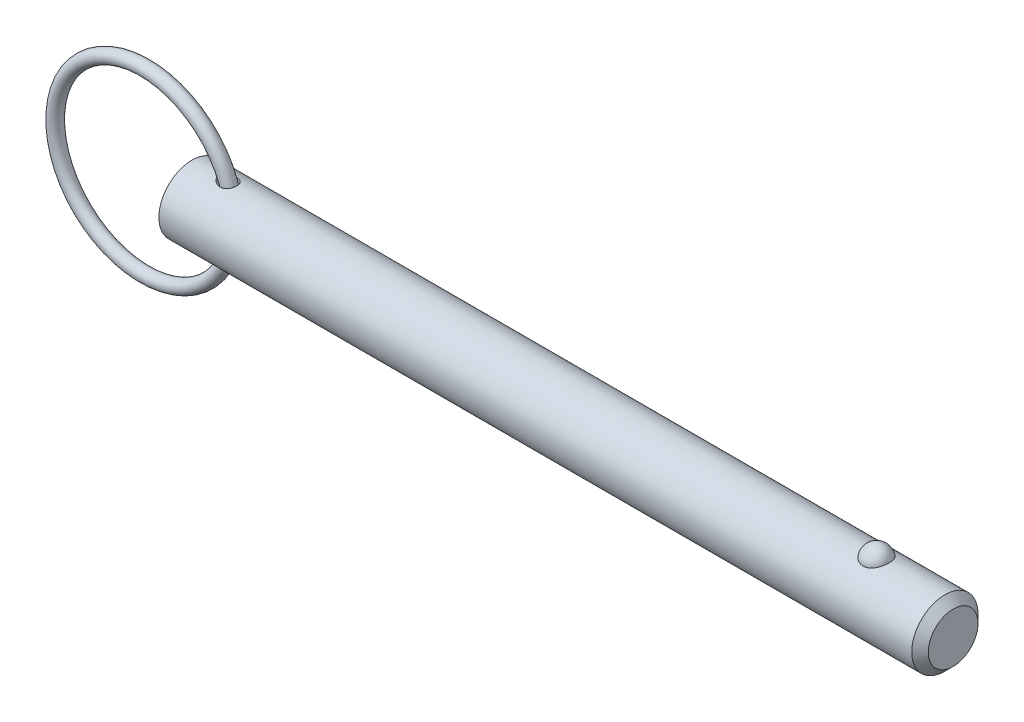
ISO-10303-21;
HEADER;
FILE_DESCRIPTION(('STEP AP214'),'2;1');
FILE_NAME('part.step','',(''),(''),'','','');
FILE_SCHEMA(('AUTOMOTIVE_DESIGN { 1 0 10303 214 1 1 1 1 }'));
ENDSEC;
DATA;
#1=APPLICATION_CONTEXT('core data for automotive mechanical design processes');
#2=APPLICATION_PROTOCOL_DEFINITION('international standard','automotive_design',2000,#1);
#3=PRODUCT_CONTEXT('',#1,'mechanical');
#4=PRODUCT('Part','Part','',(#3));
#5=PRODUCT_RELATED_PRODUCT_CATEGORY('part','',(#4));
#6=PRODUCT_DEFINITION_FORMATION('','',#4);
#7=PRODUCT_DEFINITION_CONTEXT('part definition',#1,'design');
#8=PRODUCT_DEFINITION('design','',#6,#7);
#9=PRODUCT_DEFINITION_SHAPE('','',#8);
#10=(LENGTH_UNIT() NAMED_UNIT(*) SI_UNIT(.MILLI.,.METRE.));
#11=(NAMED_UNIT(*) PLANE_ANGLE_UNIT() SI_UNIT($,.RADIAN.));
#12=(NAMED_UNIT(*) SI_UNIT($,.STERADIAN.) SOLID_ANGLE_UNIT());
#13=UNCERTAINTY_MEASURE_WITH_UNIT(LENGTH_MEASURE(1.E-05),#10,'distance_accuracy_value','');
#14=(GEOMETRIC_REPRESENTATION_CONTEXT(3) GLOBAL_UNCERTAINTY_ASSIGNED_CONTEXT((#13)) GLOBAL_UNIT_ASSIGNED_CONTEXT((#10,
#11,#12)) REPRESENTATION_CONTEXT('',''));
#15=CARTESIAN_POINT('',(0.,0.,0.));
#16=DIRECTION('',(0.,0.,1.));
#17=DIRECTION('',(1.,0.,0.));
#18=AXIS2_PLACEMENT_3D('',#15,#16,#17);
#19=CARTESIAN_POINT('',(-6.70471658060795,0.,0.));
#20=DIRECTION('',(0.,0.,1.));
#21=DIRECTION('',(1.,0.,0.));
#22=AXIS2_PLACEMENT_3D('',#19,#20,#21);
#23=TOROIDAL_SURFACE('',#22,12.7,0.940000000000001);
#24=CARTESIAN_POINT('',(6.93528341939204,0.,0.));
#25=VERTEX_POINT('',#24);
#26=VERTEX_LOOP('',#25);
#27=FACE_BOUND('',#26,.T.);
#28=ADVANCED_FACE('P0_F12',(#27),#23,.T.);
#29=CLOSED_SHELL('',(#28));
#30=MANIFOLD_SOLID_BREP('P0_B1',#29);
#31=CARTESIAN_POINT('',(0.,0.,0.));
#32=DIRECTION('',(1.,0.,0.));
#33=DIRECTION('',(0.,0.,-1.));
#34=AXIS2_PLACEMENT_3D('',#31,#32,#33);
#35=CYLINDRICAL_SURFACE('',#34,4.7);
#36=CARTESIAN_POINT('',(4.16378072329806,4.63584137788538,-0.773934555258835));
#37=CARTESIAN_POINT('',(4.22041228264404,4.62659903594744,-0.829297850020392));
#38=CARTESIAN_POINT('',(4.28206987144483,4.61719767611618,-0.879522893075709));
#39=CARTESIAN_POINT('',(4.41303152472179,4.59925351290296,-0.968997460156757));
#40=CARTESIAN_POINT('',(4.4823442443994,4.59071170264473,-1.00823437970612));
#41=CARTESIAN_POINT('',(4.626507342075,4.5755493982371,-1.07495006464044));
#42=CARTESIAN_POINT('',(4.70135029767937,4.56892638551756,-1.10244426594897));
#43=CARTESIAN_POINT('',(4.85470490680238,4.55848940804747,-1.14483874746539));
#44=CARTESIAN_POINT('',(4.93321503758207,4.55467428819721,-1.15974420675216));
#45=CARTESIAN_POINT('',(5.09197970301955,4.55051176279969,-1.17597559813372));
#46=CARTESIAN_POINT('',(5.17223836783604,4.55017372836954,-1.17726483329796));
#47=CARTESIAN_POINT('',(5.33159446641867,4.55326696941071,-1.16524823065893));
#48=CARTESIAN_POINT('',(5.41069268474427,4.55669556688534,-1.15195276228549));
#49=CARTESIAN_POINT('',(5.55698758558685,4.56647801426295,-1.11249214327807));
#50=CARTESIAN_POINT('',(5.62458628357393,4.57250771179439,-1.08773548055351));
#51=CARTESIAN_POINT('',(5.75397700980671,4.58665356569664,-1.02644632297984));
#52=CARTESIAN_POINT('',(5.81577171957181,4.59476875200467,-0.989919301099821));
#53=CARTESIAN_POINT('',(5.9268148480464,4.61135052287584,-0.909391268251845));
#54=CARTESIAN_POINT('',(5.9766679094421,4.61973919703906,-0.866204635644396));
#55=CARTESIAN_POINT('',(6.06817854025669,4.63643253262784,-0.771868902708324));
#56=CARTESIAN_POINT('',(6.10983710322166,4.64473720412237,-0.720720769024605));
#57=CARTESIAN_POINT('',(6.18318089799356,4.660174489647,-0.612928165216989));
#58=CARTESIAN_POINT('',(6.21503150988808,4.66732544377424,-0.556398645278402));
#59=CARTESIAN_POINT('',(6.26900210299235,4.67985590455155,-0.438689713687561));
#60=CARTESIAN_POINT('',(6.29112194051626,4.68523538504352,-0.377510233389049));
#61=CARTESIAN_POINT('',(6.32523846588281,4.6936733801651,-0.251831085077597));
#62=CARTESIAN_POINT('',(6.33717189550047,4.69671737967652,-0.187313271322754));
#63=CARTESIAN_POINT('',(6.35042407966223,4.70010386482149,-0.0571258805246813));
#64=CARTESIAN_POINT('',(6.3517424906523,4.70044626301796,0.00854373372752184));
#65=CARTESIAN_POINT('',(6.34371729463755,4.69838816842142,0.139481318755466));
#66=CARTESIAN_POINT('',(6.33432596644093,4.69597539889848,0.204746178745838));
#67=CARTESIAN_POINT('',(6.30500866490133,4.68864655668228,0.332720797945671));
#68=CARTESIAN_POINT('',(6.28508259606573,4.68373046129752,0.39543053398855));
#69=CARTESIAN_POINT('',(6.23516511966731,4.67193431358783,0.516455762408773));
#70=CARTESIAN_POINT('',(6.20518126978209,4.66505573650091,0.574774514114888));
#71=CARTESIAN_POINT('',(6.1358631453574,4.65009270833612,0.685387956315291));
#72=CARTESIAN_POINT('',(6.09652950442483,4.64200833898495,0.737683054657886));
#73=CARTESIAN_POINT('',(6.00979078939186,4.62559001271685,0.834455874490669));
#74=CARTESIAN_POINT('',(5.96243625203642,4.61725787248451,0.878979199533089));
#75=CARTESIAN_POINT('',(5.86079843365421,4.60122574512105,0.959378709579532));
#76=CARTESIAN_POINT('',(5.80651591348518,4.59352568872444,0.995255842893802));
#77=CARTESIAN_POINT('',(5.69277386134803,4.57961669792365,1.05741527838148));
#78=CARTESIAN_POINT('',(5.63333134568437,4.57340309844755,1.08372773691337));
#79=CARTESIAN_POINT('',(5.5108424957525,4.56305640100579,1.12650026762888));
#80=CARTESIAN_POINT('',(5.44779577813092,4.55892352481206,1.14295928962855));
#81=CARTESIAN_POINT('',(5.3179566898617,4.55299444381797,1.1663590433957));
#82=CARTESIAN_POINT('',(5.25110869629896,4.55127026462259,1.17300670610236));
#83=CARTESIAN_POINT('',(5.11716812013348,4.55043953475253,1.17622268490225));
#84=CARTESIAN_POINT('',(5.05007546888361,4.55133378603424,1.17278791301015));
#85=CARTESIAN_POINT('',(4.91166083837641,4.55569951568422,1.15571913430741));
#86=CARTESIAN_POINT('',(4.84044690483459,4.55937764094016,1.1412666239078));
#87=CARTESIAN_POINT('',(4.70108819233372,4.56903562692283,1.10196123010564));
#88=CARTESIAN_POINT('',(4.63294574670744,4.57501720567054,1.07710058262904));
#89=CARTESIAN_POINT('',(4.4947730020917,4.58927184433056,1.01474439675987));
#90=CARTESIAN_POINT('',(4.42520748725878,4.59771156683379,0.976252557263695));
#91=CARTESIAN_POINT('',(4.29354165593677,4.61552030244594,0.888246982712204));
#92=CARTESIAN_POINT('',(4.23143936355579,4.62488906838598,0.838736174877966));
#93=CARTESIAN_POINT('',(4.12609666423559,4.64192969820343,0.738015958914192));
#94=CARTESIAN_POINT('',(4.08142630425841,4.64963595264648,0.688308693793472));
#95=CARTESIAN_POINT('',(4.0008117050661,4.66411457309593,0.582144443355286));
#96=CARTESIAN_POINT('',(3.96485623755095,4.6708881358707,0.525696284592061));
#97=CARTESIAN_POINT('',(3.9081839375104,4.68183565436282,0.41591755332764));
#98=CARTESIAN_POINT('',(3.88599581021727,4.68624644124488,0.363372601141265));
#99=CARTESIAN_POINT('',(3.85055971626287,4.693376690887,0.255230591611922));
#100=CARTESIAN_POINT('',(3.83730635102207,4.69609717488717,0.199635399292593));
#101=CARTESIAN_POINT('',(3.82058225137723,4.69954043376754,0.0867104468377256));
#102=CARTESIAN_POINT('',(3.81714632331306,4.70025610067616,0.0293752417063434));
#103=CARTESIAN_POINT('',(3.8204140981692,4.69957935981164,-0.084992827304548));
#104=CARTESIAN_POINT('',(3.82711802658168,4.69818690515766,-0.142025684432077));
#105=CARTESIAN_POINT('',(3.84950128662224,4.69360426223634,-0.250744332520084));
#106=CARTESIAN_POINT('',(3.86463891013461,4.69052274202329,-0.302548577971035));
#107=CARTESIAN_POINT('',(3.9026119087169,4.68295207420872,-0.403121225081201));
#108=CARTESIAN_POINT('',(3.92544863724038,4.67846267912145,-0.451889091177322));
#109=CARTESIAN_POINT('',(3.9799930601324,4.6680441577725,-0.549522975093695));
#110=CARTESIAN_POINT('',(4.01228648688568,4.66202553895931,-0.598050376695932));
#111=CARTESIAN_POINT('',(4.08340845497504,4.64931397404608,-0.689954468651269));
#112=CARTESIAN_POINT('',(4.1222426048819,4.64262045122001,-0.733326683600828));
#113=CARTESIAN_POINT('',(4.16378072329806,4.63584137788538,-0.773934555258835));
#114=B_SPLINE_CURVE_WITH_KNOTS('',3,(#36,#37,#38,#39,#40,#41,#42,#43,#44,#45,#46,#47,#48,#49,
#50,#51,#52,#53,#54,#55,#56,#57,#58,#59,#60,#61,#62,#63,#64,#65,#66,#67,#68,#69,#70,#71,#72,#73,
#74,#75,#76,#77,#78,#79,#80,#81,#82,#83,#84,#85,#86,#87,#88,#89,#90,#91,#92,#93,#94,#95,#96,#97,
#98,#99,#100,#101,#102,#103,#104,#105,#106,#107,#108,#109,#110,#111,#112,#113),.UNSPECIFIED.,
.T.,.F.,(4,2,2,2,2,2,2,2,2,2,2,2,2,2,2,2,2,2,2,2,2,2,2,2,2,2,2,2,2,2,2,2,2,2,2,2,2,2,4),(0.,
0.238977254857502,0.478227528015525,0.717162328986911,0.955998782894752,1.19547875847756,
1.43478857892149,1.65034375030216,1.86579883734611,2.06429861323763,2.2627743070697,
2.45769248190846,2.65261353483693,2.848736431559,3.04486567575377,3.24187227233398,
3.43888065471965,3.63574133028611,3.83258866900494,4.0282389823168,4.22386782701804,
4.41887441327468,4.61390177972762,4.81464443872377,5.0154485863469,5.23282834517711,
5.45037055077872,5.68914354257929,5.9278531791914,6.12887730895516,6.32964104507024,
6.50053592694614,6.67132745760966,6.84272375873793,7.01412387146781,7.17560768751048,
7.33711990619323,7.51225400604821,7.68753905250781),.UNSPECIFIED.);
#115=CARTESIAN_POINT('',(4.16378072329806,4.63584137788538,-0.773934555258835));
#116=VERTEX_POINT('',#115);
#117=EDGE_CURVE('P1_E40',#116,#116,#114,.T.);
#118=ORIENTED_EDGE('',*,*,#117,.T.);
#119=EDGE_LOOP('',(#118));
#120=FACE_BOUND('',#119,.T.);
#121=CARTESIAN_POINT('',(106.775,0.,0.));
#122=DIRECTION('',(1.,0.,0.));
#123=DIRECTION('',(0.,0.,-1.));
#124=AXIS2_PLACEMENT_3D('',#121,#122,#123);
#125=CIRCLE('',#124,4.7);
#126=CARTESIAN_POINT('',(106.775,0.,-4.7));
#127=VERTEX_POINT('',#126);
#128=EDGE_CURVE('P1_E25',#127,#127,#125,.T.);
#129=ORIENTED_EDGE('',*,*,#128,.F.);
#130=EDGE_LOOP('',(#129));
#131=FACE_BOUND('',#130,.T.);
#132=CARTESIAN_POINT('',(0.,0.,0.));
#133=DIRECTION('',(1.,0.,0.));
#134=DIRECTION('',(0.,0.,-1.));
#135=AXIS2_PLACEMENT_3D('',#132,#133,#134);
#136=CIRCLE('',#135,4.7);
#137=CARTESIAN_POINT('',(0.,0.,-4.7));
#138=VERTEX_POINT('',#137);
#139=EDGE_CURVE('P1_E9',#138,#138,#136,.T.);
#140=ORIENTED_EDGE('',*,*,#139,.T.);
#141=EDGE_LOOP('',(#140));
#142=FACE_BOUND('',#141,.T.);
#143=CARTESIAN_POINT('',(97.0806283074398,4.30387706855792,1.88855557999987));
#144=CARTESIAN_POINT('',(96.9828134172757,4.30388592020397,1.88854684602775));
#145=CARTESIAN_POINT('',(96.8848511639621,4.30731231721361,1.88078712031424));
#146=CARTESIAN_POINT('',(96.691662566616,4.32065009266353,1.84993192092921));
#147=CARTESIAN_POINT('',(96.5964438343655,4.33057798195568,1.82679740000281));
#148=CARTESIAN_POINT('',(96.4118175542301,4.3557457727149,1.76594245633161));
#149=CARTESIAN_POINT('',(96.3223953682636,4.37097162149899,1.72826059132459));
#150=CARTESIAN_POINT('',(96.1513907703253,4.4050778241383,1.6393730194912));
#151=CARTESIAN_POINT('',(96.069805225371,4.4239567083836,1.58817274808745));
#152=CARTESIAN_POINT('',(95.9139011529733,4.46404088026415,1.47181116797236));
#153=CARTESIAN_POINT('',(95.8398759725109,4.48529915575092,1.40627540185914));
#154=CARTESIAN_POINT('',(95.7035361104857,4.527485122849,1.2638780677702));
#155=CARTESIAN_POINT('',(95.6412249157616,4.54841271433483,1.18701313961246));
#156=CARTESIAN_POINT('',(95.5270723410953,4.58876216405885,1.02025841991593));
#157=CARTESIAN_POINT('',(95.4758113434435,4.60807744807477,0.929944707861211));
#158=CARTESIAN_POINT('',(95.3884245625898,4.6421320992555,0.74146886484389));
#159=CARTESIAN_POINT('',(95.3522995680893,4.65687122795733,0.643306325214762));
#160=CARTESIAN_POINT('',(95.2956718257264,4.68038485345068,0.440967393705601));
#161=CARTESIAN_POINT('',(95.2753048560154,4.68910744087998,0.336746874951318));
#162=CARTESIAN_POINT('',(95.2511323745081,4.69949255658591,0.126059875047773));
#163=CARTESIAN_POINT('',(95.2473260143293,4.70115544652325,0.0195935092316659));
#164=CARTESIAN_POINT('',(95.2563081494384,4.69727256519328,-0.191500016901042));
#165=CARTESIAN_POINT('',(95.2689415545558,4.69179416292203,-0.296135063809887));
#166=CARTESIAN_POINT('',(95.3102760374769,4.67429351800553,-0.501612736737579));
#167=CARTESIAN_POINT('',(95.3389773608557,4.66227117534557,-0.602455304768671));
#168=CARTESIAN_POINT('',(95.4119285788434,4.63286427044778,-0.79770793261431));
#169=CARTESIAN_POINT('',(95.4562044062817,4.61547077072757,-0.892106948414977));
#170=CARTESIAN_POINT('',(95.5594074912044,4.57709900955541,-1.07173134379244));
#171=CARTESIAN_POINT('',(95.6183362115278,4.55612039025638,-1.15695580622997));
#172=CARTESIAN_POINT('',(95.7502161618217,4.51257918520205,-1.31664252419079));
#173=CARTESIAN_POINT('',(95.8232867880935,4.49000423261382,-1.39100294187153));
#174=CARTESIAN_POINT('',(95.9814784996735,4.44594443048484,-1.52598548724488));
#175=CARTESIAN_POINT('',(96.0665990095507,4.42445952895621,-1.58660827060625));
#176=CARTESIAN_POINT('',(96.2452673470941,4.38543655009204,-1.69145998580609));
#177=CARTESIAN_POINT('',(96.3386518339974,4.36783887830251,-1.73594433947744));
#178=CARTESIAN_POINT('',(96.5324220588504,4.3382941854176,-1.8085227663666));
#179=CARTESIAN_POINT('',(96.6328051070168,4.32634500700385,-1.83662309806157));
#180=CARTESIAN_POINT('',(96.8322875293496,4.31005085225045,-1.87453136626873));
#181=CARTESIAN_POINT('',(96.9311967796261,4.30535309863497,-1.88518956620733));
#182=CARTESIAN_POINT('',(97.1295210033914,4.30299844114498,-1.89055986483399));
#183=CARTESIAN_POINT('',(97.2289358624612,4.30534000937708,-1.88527542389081));
#184=CARTESIAN_POINT('',(97.4218638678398,4.31657737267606,-1.85939299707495));
#185=CARTESIAN_POINT('',(97.5154624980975,4.32524571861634,-1.83932621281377));
#186=CARTESIAN_POINT('',(97.6977839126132,4.34791518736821,-1.7850744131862));
#187=CARTESIAN_POINT('',(97.7865063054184,4.36191673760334,-1.75088826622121));
#188=CARTESIAN_POINT('',(97.958694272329,4.39411605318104,-1.66845234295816));
#189=CARTESIAN_POINT('',(98.0420089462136,4.41239631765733,-1.61992036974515));
#190=CARTESIAN_POINT('',(98.199399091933,4.45109244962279,-1.51034589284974));
#191=CARTESIAN_POINT('',(98.2734723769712,4.47150882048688,-1.44930043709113));
#192=CARTESIAN_POINT('',(98.4144058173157,4.51353865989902,-1.31275193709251));
#193=CARTESIAN_POINT('',(98.4807014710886,4.53515983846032,-1.23666813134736));
#194=CARTESIAN_POINT('',(98.6000698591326,4.57635116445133,-1.07425533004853));
#195=CARTESIAN_POINT('',(98.65314024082,4.59592094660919,-0.987924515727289));
#196=CARTESIAN_POINT('',(98.7464438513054,4.63161819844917,-0.804428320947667));
#197=CARTESIAN_POINT('',(98.7862298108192,4.64762063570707,-0.707010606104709));
#198=CARTESIAN_POINT('',(98.8498257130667,4.67374032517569,-0.506344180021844));
#199=CARTESIAN_POINT('',(98.8736358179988,4.68385763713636,-0.403095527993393));
#200=CARTESIAN_POINT('',(98.9047510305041,4.69716075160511,-0.193975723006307));
#201=CARTESIAN_POINT('',(98.9120987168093,4.70036443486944,-0.088112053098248));
#202=CARTESIAN_POINT('',(98.9102611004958,4.6995691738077,0.123441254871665));
#203=CARTESIAN_POINT('',(98.9010764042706,4.69557049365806,0.229130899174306));
#204=CARTESIAN_POINT('',(98.8664922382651,4.68082941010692,0.436545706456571));
#205=CARTESIAN_POINT('',(98.841209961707,4.67013575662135,0.53829393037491));
#206=CARTESIAN_POINT('',(98.775050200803,4.64311776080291,0.735797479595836));
#207=CARTESIAN_POINT('',(98.734171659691,4.62679303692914,0.831552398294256));
#208=CARTESIAN_POINT('',(98.6372869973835,4.59002712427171,1.01512750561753));
#209=CARTESIAN_POINT('',(98.5811735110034,4.56955699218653,1.10288523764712));
#210=CARTESIAN_POINT('',(98.4551085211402,4.52671789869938,1.26730106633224));
#211=CARTESIAN_POINT('',(98.3851572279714,4.50434896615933,1.34395933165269));
#212=CARTESIAN_POINT('',(98.2327247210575,4.46008413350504,1.48428028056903));
#213=CARTESIAN_POINT('',(98.1502095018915,4.43818970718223,1.54790656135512));
#214=CARTESIAN_POINT('',(97.9747358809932,4.39746476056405,1.6600850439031));
#215=CARTESIAN_POINT('',(97.8817736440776,4.37863537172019,1.70863168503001));
#216=CARTESIAN_POINT('',(97.6910997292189,4.34688784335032,1.78783023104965));
#217=CARTESIAN_POINT('',(97.5936298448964,4.33380220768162,1.81899757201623));
#218=CARTESIAN_POINT('',(97.3944052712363,4.31435159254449,1.86467392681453));
#219=CARTESIAN_POINT('',(97.2926639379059,4.30796708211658,1.87923136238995));
#220=CARTESIAN_POINT('',(97.1539136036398,4.3043503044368,1.8874737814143));
#221=CARTESIAN_POINT('',(97.1172813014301,4.30387375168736,1.8885588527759));
#222=CARTESIAN_POINT('',(97.0806283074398,4.30387706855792,1.88855557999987));
#223=B_SPLINE_CURVE_WITH_KNOTS('',3,(#143,#144,#145,#146,#147,#148,#149,#150,#151,#152,#153,
#154,#155,#156,#157,#158,#159,#160,#161,#162,#163,#164,#165,#166,#167,#168,#169,#170,#171,#172,
#173,#174,#175,#176,#177,#178,#179,#180,#181,#182,#183,#184,#185,#186,#187,#188,#189,#190,#191,
#192,#193,#194,#195,#196,#197,#198,#199,#200,#201,#202,#203,#204,#205,#206,#207,#208,#209,#210,
#211,#212,#213,#214,#215,#216,#217,#218,#219,#220,#221,#222),.UNSPECIFIED.,.T.,.F.,(4,2,2,2,2,2,
2,2,2,2,2,2,2,2,2,2,2,2,2,2,2,2,2,2,2,2,2,2,2,2,2,2,2,2,2,2,2,2,2,4),(0.,0.293339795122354,
0.587427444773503,0.880740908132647,1.17393661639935,1.47597417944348,1.77810150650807,
2.09350493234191,2.40892479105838,2.72703308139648,3.04512507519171,3.36023788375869,
3.67535550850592,3.99100033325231,4.30667668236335,4.62514463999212,4.94359739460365,
5.25676407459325,5.56981105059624,5.86708641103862,6.1642972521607,6.45131888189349,
6.73836351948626,7.03148013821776,7.3246659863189,7.63288296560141,7.94115473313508,
8.25895074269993,8.57674352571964,8.89371340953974,9.21067166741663,9.52534839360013,
9.84004644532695,10.157022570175,10.4739938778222,10.7918388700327,11.1098009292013,
11.41774884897,11.7247967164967,11.834716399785),.UNSPECIFIED.);
#224=CARTESIAN_POINT('',(97.0806283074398,4.30387706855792,1.88855557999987));
#225=VERTEX_POINT('',#224);
#226=EDGE_CURVE('P1_E34',#225,#225,#223,.T.);
#227=ORIENTED_EDGE('',*,*,#226,.T.);
#228=EDGE_LOOP('',(#227));
#229=FACE_BOUND('',#228,.T.);
#230=CARTESIAN_POINT('',(4.16378072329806,-4.63584137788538,-0.773934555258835));
#231=CARTESIAN_POINT('',(4.11797605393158,-4.64331682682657,-0.729154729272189));
#232=CARTESIAN_POINT('',(4.07545237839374,-4.65068929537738,-0.681007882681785));
#233=CARTESIAN_POINT('',(3.99850919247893,-4.66454993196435,-0.578483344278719));
#234=CARTESIAN_POINT('',(3.9640846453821,-4.67103864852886,-0.524109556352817));
#235=CARTESIAN_POINT('',(3.90486465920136,-4.68247538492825,-0.409579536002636));
#236=CARTESIAN_POINT('',(3.88014787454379,-4.68741075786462,-0.349380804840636));
#237=CARTESIAN_POINT('',(3.84254060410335,-4.69500854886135,-0.225256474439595));
#238=CARTESIAN_POINT('',(3.8296375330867,-4.69767338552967,-0.161334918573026));
#239=CARTESIAN_POINT('',(3.81750619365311,-4.70018000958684,-0.0396774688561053));
#240=CARTESIAN_POINT('',(3.8168623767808,-4.70031401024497,0.017913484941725));
#241=CARTESIAN_POINT('',(3.82570055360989,-4.69848615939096,0.132270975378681));
#242=CARTESIAN_POINT('',(3.83518142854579,-4.6965245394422,0.189037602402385));
#243=CARTESIAN_POINT('',(3.8627670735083,-4.69091189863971,0.296808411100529));
#244=CARTESIAN_POINT('',(3.88034293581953,-4.68736483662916,0.347956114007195));
#245=CARTESIAN_POINT('',(3.92293217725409,-4.67896699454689,0.446919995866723));
#246=CARTESIAN_POINT('',(3.94794743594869,-4.67411588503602,0.494735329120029));
#247=CARTESIAN_POINT('',(4.00723361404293,-4.66297432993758,0.590975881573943));
#248=CARTESIAN_POINT('',(4.04218787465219,-4.65658759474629,0.638966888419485));
#249=CARTESIAN_POINT('',(4.11850165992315,-4.6432741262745,0.729452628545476));
#250=CARTESIAN_POINT('',(4.15986486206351,-4.63634708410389,0.771944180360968));
#251=CARTESIAN_POINT('',(4.25563139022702,-4.62124878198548,0.858077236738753));
#252=CARTESIAN_POINT('',(4.3110472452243,-4.61307408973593,0.900593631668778));
#253=CARTESIAN_POINT('',(4.42760239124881,-4.59748077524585,0.977085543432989));
#254=CARTESIAN_POINT('',(4.48874590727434,-4.59006271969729,1.01105468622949));
#255=CARTESIAN_POINT('',(4.62409915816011,-4.57577604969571,1.07399161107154));
#256=CARTESIAN_POINT('',(4.69895162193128,-4.56912175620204,1.10163764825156));
#257=CARTESIAN_POINT('',(4.85238616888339,-4.55861611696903,1.14433682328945));
#258=CARTESIAN_POINT('',(4.93096882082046,-4.55476520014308,1.15938803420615));
#259=CARTESIAN_POINT('',(5.08983848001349,-4.55053674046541,1.17587995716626));
#260=CARTESIAN_POINT('',(5.17012835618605,-4.55016559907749,1.17729558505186));
#261=CARTESIAN_POINT('',(5.32956049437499,-4.55319561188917,1.16552635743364));
#262=CARTESIAN_POINT('',(5.40870366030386,-4.55659361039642,1.15235371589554));
#263=CARTESIAN_POINT('',(5.55512154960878,-4.56632591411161,1.11311448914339));
#264=CARTESIAN_POINT('',(5.62279525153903,-4.57233592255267,1.08845479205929));
#265=CARTESIAN_POINT('',(5.75235194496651,-4.58645252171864,1.02734156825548));
#266=CARTESIAN_POINT('',(5.81423750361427,-4.59455817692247,0.990893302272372));
#267=CARTESIAN_POINT('',(5.92544729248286,-4.61112960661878,0.910507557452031));
#268=CARTESIAN_POINT('',(5.9753775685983,-4.61951638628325,0.867388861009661));
#269=CARTESIAN_POINT('',(6.06705041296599,-4.63621447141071,0.773173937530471));
#270=CARTESIAN_POINT('',(6.10879399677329,-4.64452578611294,0.722078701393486));
#271=CARTESIAN_POINT('',(6.18230323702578,-4.65998194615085,0.614385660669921));
#272=CARTESIAN_POINT('',(6.21423602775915,-4.66714520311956,0.557904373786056));
#273=CARTESIAN_POINT('',(6.26837651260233,-4.67970630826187,0.440277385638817));
#274=CARTESIAN_POINT('',(6.29058407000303,-4.68510413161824,0.379131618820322));
#275=CARTESIAN_POINT('',(6.32487950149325,-4.69358284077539,0.253506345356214));
#276=CARTESIAN_POINT('',(6.33690441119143,-4.69664929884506,0.189008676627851));
#277=CARTESIAN_POINT('',(6.3503414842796,-4.70008248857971,0.0588455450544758));
#278=CARTESIAN_POINT('',(6.35175330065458,-4.70044913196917,-0.00681995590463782));
#279=CARTESIAN_POINT('',(6.34391515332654,-4.69843881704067,-0.137767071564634));
#280=CARTESIAN_POINT('',(6.33461722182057,-4.69604951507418,-0.203045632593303));
#281=CARTESIAN_POINT('',(6.30548404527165,-4.68876413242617,-0.331063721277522));
#282=CARTESIAN_POINT('',(6.2856487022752,-4.68386802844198,-0.393803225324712));
#283=CARTESIAN_POINT('',(6.23590713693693,-4.67210599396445,-0.514904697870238));
#284=CARTESIAN_POINT('',(6.20600824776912,-4.66524149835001,-0.573269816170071));
#285=CARTESIAN_POINT('',(6.13685224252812,-4.65029918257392,-0.683989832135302));
#286=CARTESIAN_POINT('',(6.09759575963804,-4.6422214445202,-0.736345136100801));
#287=CARTESIAN_POINT('',(6.01099960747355,-4.62580793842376,-0.833250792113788));
#288=CARTESIAN_POINT('',(5.96371037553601,-4.61747403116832,-0.87784652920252));
#289=CARTESIAN_POINT('',(5.86219002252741,-4.60143050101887,-0.958399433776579));
#290=CARTESIAN_POINT('',(5.80795966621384,-4.59372080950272,-0.994357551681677));
#291=CARTESIAN_POINT('',(5.69431062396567,-4.57978661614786,-1.05668157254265));
#292=CARTESIAN_POINT('',(5.63490936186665,-4.57355737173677,-1.08307825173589));
#293=CARTESIAN_POINT('',(5.51248756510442,-4.56317492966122,-1.12602176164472));
#294=CARTESIAN_POINT('',(5.44946662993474,-4.55902196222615,-1.1425675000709));
#295=CARTESIAN_POINT('',(5.3196775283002,-4.55305083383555,-1.16613984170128));
#296=CARTESIAN_POINT('',(5.25285368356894,-4.55130415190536,-1.17287534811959));
#297=CARTESIAN_POINT('',(5.11894995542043,-4.55042807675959,-1.17626714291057));
#298=CARTESIAN_POINT('',(5.05187000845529,-4.55129938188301,-1.17292074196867));
#299=CARTESIAN_POINT('',(4.91348721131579,-4.55561850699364,-1.15603764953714));
#300=CARTESIAN_POINT('',(4.84229084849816,-4.55927235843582,-1.14168541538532));
#301=CARTESIAN_POINT('',(4.70293860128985,-4.56888540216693,-1.10258192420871));
#302=CARTESIAN_POINT('',(4.63478566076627,-4.57484677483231,-1.07782082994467));
#303=CARTESIAN_POINT('',(4.49401200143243,-4.58932889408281,-1.01452290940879));
#304=CARTESIAN_POINT('',(4.42204931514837,-4.59808779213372,-0.974568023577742));
#305=CARTESIAN_POINT('',(4.28620227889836,-4.61656806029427,-0.88288117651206));
#306=CARTESIAN_POINT('',(4.22231268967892,-4.62628879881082,-0.831156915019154));
#307=CARTESIAN_POINT('',(4.16378072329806,-4.63584137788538,-0.773934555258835));
#308=B_SPLINE_CURVE_WITH_KNOTS('',3,(#230,#231,#232,#233,#234,#235,#236,#237,#238,#239,#240,
#241,#242,#243,#244,#245,#246,#247,#248,#249,#250,#251,#252,#253,#254,#255,#256,#257,#258,#259,
#260,#261,#262,#263,#264,#265,#266,#267,#268,#269,#270,#271,#272,#273,#274,#275,#276,#277,#278,
#279,#280,#281,#282,#283,#284,#285,#286,#287,#288,#289,#290,#291,#292,#293,#294,#295,#296,#297,
#298,#299,#300,#301,#302,#303,#304,#305,#306,#307),.UNSPECIFIED.,.T.,.F.,(4,2,2,2,2,2,2,2,2,2,2,
2,2,2,2,2,2,2,2,2,2,2,2,2,2,2,2,2,2,2,2,2,2,2,2,2,2,2,4),(0.,0.19326332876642,0.386406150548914,
0.581083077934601,0.775552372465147,0.947410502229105,1.11924964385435,1.28117818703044,
1.44314767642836,1.62161944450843,1.80019400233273,2.01034324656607,2.22064874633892,
2.45975127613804,2.69889038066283,2.93846932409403,3.1778478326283,3.39350806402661,
3.60907218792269,3.80761226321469,4.00612769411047,4.20104508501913,4.39596521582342,
4.59208201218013,4.78820522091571,4.98521027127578,5.18221715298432,5.37908078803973,
5.5759311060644,5.77158824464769,5.96722384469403,6.1622240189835,6.35724581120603,
6.55794420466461,6.75869613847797,6.97596054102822,7.19343073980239,7.44055547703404,
7.68751900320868),.UNSPECIFIED.);
#309=CARTESIAN_POINT('',(4.16378072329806,-4.63584137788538,-0.773934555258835));
#310=VERTEX_POINT('',#309);
#311=EDGE_CURVE('P1_E17',#310,#310,#308,.T.);
#312=ORIENTED_EDGE('',*,*,#311,.T.);
#313=EDGE_LOOP('',(#312));
#314=FACE_BOUND('',#313,.T.);
#315=ADVANCED_FACE('P1_F13',(#120,#131,#142,#229,#314),#35,.T.);
#316=CARTESIAN_POINT('',(0.,0.,0.));
#317=DIRECTION('',(-1.,0.,0.));
#318=DIRECTION('',(0.,0.,1.));
#319=AXIS2_PLACEMENT_3D('',#316,#317,#318);
#320=PLANE('',#319);
#321=ORIENTED_EDGE('',*,*,#139,.F.);
#322=EDGE_LOOP('',(#321));
#323=FACE_BOUND('',#322,.T.);
#324=ADVANCED_FACE('P1_F15',(#323),#320,.T.);
#325=CARTESIAN_POINT('',(107.95,0.,0.));
#326=DIRECTION('',(-1.,0.,0.));
#327=DIRECTION('',(0.,0.,1.));
#328=AXIS2_PLACEMENT_3D('',#325,#326,#327);
#329=CONICAL_SURFACE('',#328,3.52500000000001,0.785398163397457);
#330=ORIENTED_EDGE('',*,*,#128,.T.);
#331=EDGE_LOOP('',(#330));
#332=FACE_BOUND('',#331,.T.);
#333=CARTESIAN_POINT('',(107.95,0.,0.));
#334=DIRECTION('',(1.,0.,0.));
#335=DIRECTION('',(0.,0.,-1.));
#336=AXIS2_PLACEMENT_3D('',#333,#334,#335);
#337=CIRCLE('',#336,3.52500000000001);
#338=CARTESIAN_POINT('',(107.95,0.,-3.52500000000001));
#339=VERTEX_POINT('',#338);
#340=EDGE_CURVE('P1_E30',#339,#339,#337,.T.);
#341=ORIENTED_EDGE('',*,*,#340,.F.);
#342=EDGE_LOOP('',(#341));
#343=FACE_BOUND('',#342,.T.);
#344=ADVANCED_FACE('P1_F55',(#332,#343),#329,.T.);
#345=CARTESIAN_POINT('',(107.95,3.52500000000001,0.));
#346=DIRECTION('',(1.,0.,0.));
#347=DIRECTION('',(0.,0.,-1.));
#348=AXIS2_PLACEMENT_3D('',#345,#346,#347);
#349=PLANE('',#348);
#350=ORIENTED_EDGE('',*,*,#340,.T.);
#351=EDGE_LOOP('',(#350));
#352=FACE_BOUND('',#351,.T.);
#353=ADVANCED_FACE('P1_F51',(#352),#349,.T.);
#354=CARTESIAN_POINT('',(97.0806283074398,4.23,0.));
#355=DIRECTION('',(-1.,0.,0.));
#356=DIRECTION('',(0.,1.,0.));
#357=AXIS2_PLACEMENT_3D('',#354,#355,#356);
#358=SPHERICAL_SURFACE('',#357,1.89);
#359=ORIENTED_EDGE('',*,*,#226,.F.);
#360=EDGE_LOOP('',(#359));
#361=FACE_BOUND('',#360,.T.);
#362=ADVANCED_FACE('P1_F46',(#361),#358,.T.);
#363=CARTESIAN_POINT('',(-6.70471658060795,0.,0.));
#364=DIRECTION('',(0.,0.,1.));
#365=DIRECTION('',(1.,0.,0.));
#366=AXIS2_PLACEMENT_3D('',#363,#364,#365);
#367=TOROIDAL_SURFACE('',#366,12.7,1.175);
#368=ORIENTED_EDGE('',*,*,#311,.F.);
#369=EDGE_LOOP('',(#368));
#370=FACE_BOUND('',#369,.T.);
#371=ORIENTED_EDGE('',*,*,#117,.F.);
#372=EDGE_LOOP('',(#371));
#373=FACE_BOUND('',#372,.T.);
#374=ADVANCED_FACE('P1_F50',(#370,#373),#367,.F.);
#375=CLOSED_SHELL('',(#315,#324,#344,#353,#362,#374));
#376=MANIFOLD_SOLID_BREP('P1_B1',#375);
#377=ADVANCED_BREP_SHAPE_REPRESENTATION('',(#18,#30,#376),#14);
#378=SHAPE_DEFINITION_REPRESENTATION(#9,#377);
ENDSEC;
END-ISO-10303-21;
